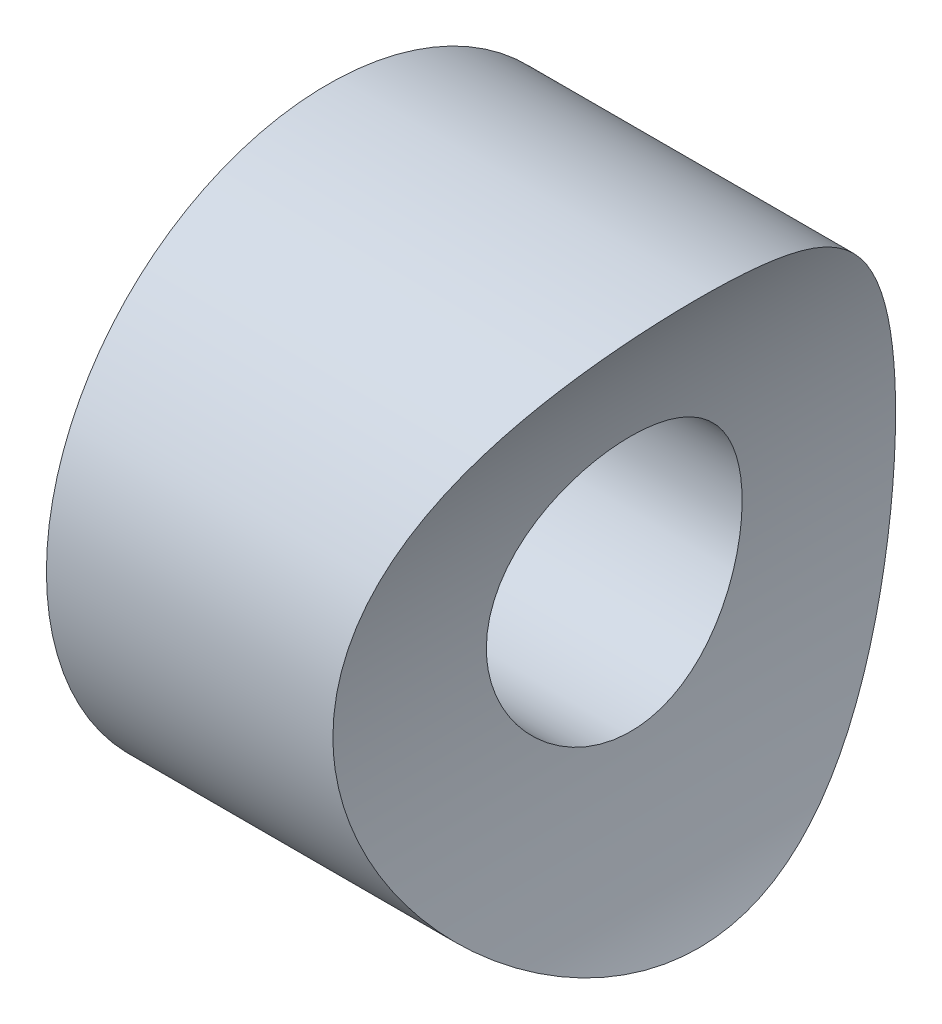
ISO-10303-21;
HEADER;
FILE_DESCRIPTION(('STEP AP214'),'2;1');
FILE_NAME('part.step','',(''),(''),'','','');
FILE_SCHEMA(('AUTOMOTIVE_DESIGN { 1 0 10303 214 1 1 1 1 }'));
ENDSEC;
DATA;
#1=APPLICATION_CONTEXT('core data for automotive mechanical design processes');
#2=APPLICATION_PROTOCOL_DEFINITION('international standard','automotive_design',2000,#1);
#3=PRODUCT_CONTEXT('',#1,'mechanical');
#4=PRODUCT('Part','Part','',(#3));
#5=PRODUCT_RELATED_PRODUCT_CATEGORY('part','',(#4));
#6=PRODUCT_DEFINITION_FORMATION('','',#4);
#7=PRODUCT_DEFINITION_CONTEXT('part definition',#1,'design');
#8=PRODUCT_DEFINITION('design','',#6,#7);
#9=PRODUCT_DEFINITION_SHAPE('','',#8);
#10=(LENGTH_UNIT() NAMED_UNIT(*) SI_UNIT(.MILLI.,.METRE.));
#11=(NAMED_UNIT(*) PLANE_ANGLE_UNIT() SI_UNIT($,.RADIAN.));
#12=(NAMED_UNIT(*) SI_UNIT($,.STERADIAN.) SOLID_ANGLE_UNIT());
#13=UNCERTAINTY_MEASURE_WITH_UNIT(LENGTH_MEASURE(1.E-05),#10,'distance_accuracy_value','');
#14=(GEOMETRIC_REPRESENTATION_CONTEXT(3) GLOBAL_UNCERTAINTY_ASSIGNED_CONTEXT((#13)) GLOBAL_UNIT_ASSIGNED_CONTEXT((#10,
#11,#12)) REPRESENTATION_CONTEXT('',''));
#15=CARTESIAN_POINT('',(0.,0.,0.));
#16=DIRECTION('',(0.,0.,1.));
#17=DIRECTION('',(1.,0.,0.));
#18=AXIS2_PLACEMENT_3D('',#15,#16,#17);
#19=CARTESIAN_POINT('',(0.,0.,0.));
#20=DIRECTION('',(1.,0.,0.));
#21=DIRECTION('',(0.,0.,-1.));
#22=AXIS2_PLACEMENT_3D('',#19,#20,#21);
#23=PLANE('',#22);
#24=CARTESIAN_POINT('',(0.,0.,0.));
#25=DIRECTION('',(1.,0.,0.));
#26=DIRECTION('',(0.,0.,-1.));
#27=AXIS2_PLACEMENT_3D('',#24,#25,#26);
#28=CIRCLE('',#27,27.5);
#29=CARTESIAN_POINT('',(0.,0.,-27.5));
#30=VERTEX_POINT('',#29);
#31=EDGE_CURVE('E10',#30,#30,#28,.T.);
#32=ORIENTED_EDGE('',*,*,#31,.F.);
#33=EDGE_LOOP('',(#32));
#34=FACE_BOUND('',#33,.T.);
#35=CARTESIAN_POINT('',(0.,0.,0.));
#36=DIRECTION('',(1.,0.,0.));
#37=DIRECTION('',(0.,0.,-1.));
#38=AXIS2_PLACEMENT_3D('',#35,#36,#37);
#39=CIRCLE('',#38,12.5);
#40=CARTESIAN_POINT('',(0.,0.,-12.5));
#41=VERTEX_POINT('',#40);
#42=EDGE_CURVE('E41',#41,#41,#39,.T.);
#43=ORIENTED_EDGE('',*,*,#42,.T.);
#44=EDGE_LOOP('',(#43));
#45=FACE_BOUND('',#44,.T.);
#46=ADVANCED_FACE('F28',(#34,#45),#23,.F.);
#47=CARTESIAN_POINT('',(40.,0.,0.));
#48=DIRECTION('',(-1.,0.,0.));
#49=DIRECTION('',(0.,0.,1.));
#50=AXIS2_PLACEMENT_3D('',#47,#48,#49);
#51=CYLINDRICAL_SURFACE('',#50,27.5);
#52=CARTESIAN_POINT('',(28.,0.,27.5));
#53=CARTESIAN_POINT('',(28.0000058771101,0.71406770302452,27.4999933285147));
#54=CARTESIAN_POINT('',(28.0153356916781,1.42829199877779,27.47214748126));
#55=CARTESIAN_POINT('',(28.0762780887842,2.85123638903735,27.3611055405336));
#56=CARTESIAN_POINT('',(28.1218996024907,3.55995479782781,27.2778931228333));
#57=CARTESIAN_POINT('',(28.2423267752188,4.96721444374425,27.0570623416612));
#58=CARTESIAN_POINT('',(28.3171671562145,5.66574254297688,26.9193792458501));
#59=CARTESIAN_POINT('',(28.4941532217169,7.04668581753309,26.5913128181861));
#60=CARTESIAN_POINT('',(28.5962971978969,7.72910199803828,26.4009327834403));
#61=CARTESIAN_POINT('',(28.8249571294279,9.07062743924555,25.970520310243));
#62=CARTESIAN_POINT('',(28.9513697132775,9.72982199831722,25.7306981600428));
#63=CARTESIAN_POINT('',(29.2259609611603,11.0241021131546,25.2033242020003));
#64=CARTESIAN_POINT('',(29.3741398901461,11.6591873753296,24.9157718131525));
#65=CARTESIAN_POINT('',(29.6890348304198,12.9019995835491,24.2954880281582));
#66=CARTESIAN_POINT('',(29.8557493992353,13.5097286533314,23.9627601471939));
#67=CARTESIAN_POINT('',(30.2042666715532,14.6952262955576,23.2546150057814));
#68=CARTESIAN_POINT('',(30.3860699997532,15.2729936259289,22.8791959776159));
#69=CARTESIAN_POINT('',(30.7740256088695,16.4349578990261,22.0608534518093));
#70=CARTESIAN_POINT('',(30.9809925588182,17.0168641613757,21.6150630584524));
#71=CARTESIAN_POINT('',(31.4033625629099,18.1415065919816,20.6801963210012));
#72=CARTESIAN_POINT('',(31.6187659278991,18.6842413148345,20.1911183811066));
#73=CARTESIAN_POINT('',(32.0533701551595,19.7288494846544,19.1717379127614));
#74=CARTESIAN_POINT('',(32.2725741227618,20.2306874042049,18.6414003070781));
#75=CARTESIAN_POINT('',(32.7095663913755,21.1909163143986,17.5421697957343));
#76=CARTESIAN_POINT('',(32.9273546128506,21.6493048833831,16.9732747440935));
#77=CARTESIAN_POINT('',(33.3774278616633,22.5634788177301,15.7411708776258));
#78=CARTESIAN_POINT('',(33.6090226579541,23.0145435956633,15.0741949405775));
#79=CARTESIAN_POINT('',(34.0568488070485,23.8584948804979,13.699373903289));
#80=CARTESIAN_POINT('',(34.2730788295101,24.2513763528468,12.9915252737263));
#81=CARTESIAN_POINT('',(34.6824358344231,24.9752178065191,11.5389135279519));
#82=CARTESIAN_POINT('',(34.8755763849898,25.3062142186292,10.7941724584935));
#83=CARTESIAN_POINT('',(35.2312084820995,25.9027263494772,9.27182878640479));
#84=CARTESIAN_POINT('',(35.3937040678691,26.168250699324,8.49423053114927));
#85=CARTESIAN_POINT('',(35.6717090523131,26.6154232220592,6.96172199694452));
#86=CARTESIAN_POINT('',(35.7895340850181,26.8013025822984,6.20846993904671));
#87=CARTESIAN_POINT('',(35.9866776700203,27.1093039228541,4.68402776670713));
#88=CARTESIAN_POINT('',(36.0659982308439,27.2314292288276,3.91283859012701));
#89=CARTESIAN_POINT('',(36.1822474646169,27.4096144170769,2.36062538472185));
#90=CARTESIAN_POINT('',(36.2192281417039,27.4657553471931,1.57961461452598));
#91=CARTESIAN_POINT('',(36.249087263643,27.5111276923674,0.0148543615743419));
#92=CARTESIAN_POINT('',(36.2419717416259,27.5003682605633,-0.768894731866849));
#93=CARTESIAN_POINT('',(36.188474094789,27.4189343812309,-2.21175930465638));
#94=CARTESIAN_POINT('',(36.1482429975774,27.3576432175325,-2.87166154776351));
#95=CARTESIAN_POINT('',(36.0378843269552,27.1880692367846,-4.18278760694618));
#96=CARTESIAN_POINT('',(35.9677603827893,27.0797921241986,-4.83401246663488));
#97=CARTESIAN_POINT('',(35.7999797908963,26.8175770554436,-6.12379733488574));
#98=CARTESIAN_POINT('',(35.7023127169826,26.6636218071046,-6.76235244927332));
#99=CARTESIAN_POINT('',(35.4825661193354,26.3117991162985,-8.02293679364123));
#100=CARTESIAN_POINT('',(35.3604850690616,26.1139289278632,-8.64496498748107));
#101=CARTESIAN_POINT('',(35.0926371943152,25.6715105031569,-9.88254045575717));
#102=CARTESIAN_POINT('',(34.946419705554,25.4260546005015,-10.4976647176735));
#103=CARTESIAN_POINT('',(34.6362462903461,24.8933689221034,-11.7049391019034));
#104=CARTESIAN_POINT('',(34.4722885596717,24.6061348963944,-12.2970868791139));
#105=CARTESIAN_POINT('',(34.1306799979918,23.9917960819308,-13.4563809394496));
#106=CARTESIAN_POINT('',(33.9530256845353,23.6646811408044,-14.0235208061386));
#107=CARTESIAN_POINT('',(33.5880668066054,22.9724465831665,-15.1308668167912));
#108=CARTESIAN_POINT('',(33.4007615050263,22.6073240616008,-15.6710708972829));
#109=CARTESIAN_POINT('',(32.9903491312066,21.7801909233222,-16.805983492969));
#110=CARTESIAN_POINT('',(32.7662583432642,21.3119845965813,-17.395832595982));
#111=CARTESIAN_POINT('',(32.3161371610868,20.3292112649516,-18.534806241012));
#112=CARTESIAN_POINT('',(32.090106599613,19.8146402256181,-19.083927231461));
#113=CARTESIAN_POINT('',(31.6414962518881,18.7410712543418,-20.1392433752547));
#114=CARTESIAN_POINT('',(31.4189188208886,18.1820444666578,-20.645410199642));
#115=CARTESIAN_POINT('',(30.9826809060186,17.0222090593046,-21.6116665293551));
#116=CARTESIAN_POINT('',(30.7690205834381,16.4213996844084,-22.0717552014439));
#117=CARTESIAN_POINT('',(30.3418088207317,15.1388160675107,-22.9721718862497));
#118=CARTESIAN_POINT('',(30.1292312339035,14.4543141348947,-23.4090895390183));
#119=CARTESIAN_POINT('',(29.7259652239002,13.0443540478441,-24.2230765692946));
#120=CARTESIAN_POINT('',(29.5352782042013,12.318893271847,-24.6001421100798));
#121=CARTESIAN_POINT('',(29.1814914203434,10.8321993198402,-25.2900063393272));
#122=CARTESIAN_POINT('',(29.018371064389,10.0709933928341,-25.6028530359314));
#123=CARTESIAN_POINT('',(28.7245751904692,8.51801920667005,-26.1605376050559));
#124=CARTESIAN_POINT('',(28.5938950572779,7.72625531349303,-26.4053851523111));
#125=CARTESIAN_POINT('',(28.379663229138,6.19385657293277,-26.8039791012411));
#126=CARTESIAN_POINT('',(28.2928557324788,5.45532781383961,-26.9640864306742));
#127=CARTESIAN_POINT('',(28.1518037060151,3.96455359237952,-27.2232352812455));
#128=CARTESIAN_POINT('',(28.0975572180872,3.21230895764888,-27.3222804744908));
#129=CARTESIAN_POINT('',(28.0232152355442,1.70092879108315,-27.4578262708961));
#130=CARTESIAN_POINT('',(28.0031014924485,0.941797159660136,-27.4943602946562));
#131=CARTESIAN_POINT('',(27.9975639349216,-0.576988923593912,-27.5044298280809));
#132=CARTESIAN_POINT('',(28.0121378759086,-1.3366433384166,-27.4779694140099));
#133=CARTESIAN_POINT('',(28.0724227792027,-2.77558379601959,-27.36813403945));
#134=CARTESIAN_POINT('',(28.1149464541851,-3.45545849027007,-27.290583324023));
#135=CARTESIAN_POINT('',(28.2268407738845,-4.8053300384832,-27.0855085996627));
#136=CARTESIAN_POINT('',(28.2962092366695,-5.47532769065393,-26.9579886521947));
#137=CARTESIAN_POINT('',(28.4602026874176,-6.80108163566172,-26.6544145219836));
#138=CARTESIAN_POINT('',(28.5548289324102,-7.45683721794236,-26.4783579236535));
#139=CARTESIAN_POINT('',(28.7672403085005,-8.75013600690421,-26.0795531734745));
#140=CARTESIAN_POINT('',(28.8850264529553,-9.38767841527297,-25.8568029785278));
#141=CARTESIAN_POINT('',(29.144125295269,-10.6551033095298,-25.3612322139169));
#142=CARTESIAN_POINT('',(29.2859056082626,-11.2844948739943,-25.087402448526));
#143=CARTESIAN_POINT('',(29.5880561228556,-12.5174523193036,-24.4955312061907));
#144=CARTESIAN_POINT('',(29.7484263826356,-13.1210181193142,-24.1774895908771));
#145=CARTESIAN_POINT('',(30.084542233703,-14.2998147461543,-23.4995271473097));
#146=CARTESIAN_POINT('',(30.2602914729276,-14.8750387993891,-23.1395963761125));
#147=CARTESIAN_POINT('',(30.6237365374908,-15.9948797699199,-22.3801589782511));
#148=CARTESIAN_POINT('',(30.8114334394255,-16.5394939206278,-21.9806487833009));
#149=CARTESIAN_POINT('',(31.1099562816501,-17.3614967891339,-21.3299986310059));
#150=CARTESIAN_POINT('',(31.2179245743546,-17.6502029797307,-21.091709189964));
#151=CARTESIAN_POINT('',(31.4357781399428,-18.2171747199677,-20.6039886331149));
#152=CARTESIAN_POINT('',(31.5456629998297,-18.495442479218,-20.3545599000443));
#153=CARTESIAN_POINT('',(31.8772958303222,-19.3143180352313,-19.5899192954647));
#154=CARTESIAN_POINT('',(32.1010269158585,-19.8390113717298,-19.058342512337));
#155=CARTESIAN_POINT('',(32.5485582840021,-20.8439299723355,-17.9537944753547));
#156=CARTESIAN_POINT('',(32.7723584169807,-21.3241108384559,-17.3807828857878));
#157=CARTESIAN_POINT('',(33.2142557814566,-22.2372295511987,-16.1961381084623));
#158=CARTESIAN_POINT('',(33.4323527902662,-22.6701655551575,-15.584503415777));
#159=CARTESIAN_POINT('',(33.873538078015,-23.518104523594,-14.2759573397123));
#160=CARTESIAN_POINT('',(34.0956922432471,-23.9290849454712,-13.5761143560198));
#161=CARTESIAN_POINT('',(34.5189552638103,-24.6898431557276,-12.1376918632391));
#162=CARTESIAN_POINT('',(34.7200624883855,-25.0396162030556,-11.3991093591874));
#163=CARTESIAN_POINT('',(35.0932004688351,-25.6737583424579,-9.88829638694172));
#164=CARTESIAN_POINT('',(35.2652656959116,-25.9582051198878,-9.11610719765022));
#165=CARTESIAN_POINT('',(35.5730279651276,-26.4582405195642,-7.54271108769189));
#166=CARTESIAN_POINT('',(35.7087318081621,-26.6738420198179,-6.7415096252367));
#167=CARTESIAN_POINT('',(35.9260388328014,-27.0151559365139,-5.19574202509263));
#168=CARTESIAN_POINT('',(36.0116097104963,-27.1475534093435,-4.45320929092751));
#169=CARTESIAN_POINT('',(36.1438828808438,-27.3510573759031,-2.95634012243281));
#170=CARTESIAN_POINT('',(36.190588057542,-27.4221684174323,-2.20200456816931));
#171=CARTESIAN_POINT('',(36.242918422,-27.5017895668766,-0.689161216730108));
#172=CARTESIAN_POINT('',(36.2485736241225,-27.5103454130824,0.0693431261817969));
#173=CARTESIAN_POINT('',(36.2186049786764,-27.4648103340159,1.58360896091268));
#174=CARTESIAN_POINT('',(36.1829845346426,-27.4107245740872,2.33937067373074));
#175=CARTESIAN_POINT('',(36.0797489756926,-27.2525215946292,3.73846143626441));
#176=CARTESIAN_POINT('',(36.0171583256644,-27.1562313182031,4.38307060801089));
#177=CARTESIAN_POINT('',(35.8646164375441,-26.9189402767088,5.66062477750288));
#178=CARTESIAN_POINT('',(35.7746683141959,-26.777944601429,6.293571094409));
#179=CARTESIAN_POINT('',(35.5702131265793,-26.4527880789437,7.54438751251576));
#180=CARTESIAN_POINT('',(35.4556982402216,-26.2686134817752,8.1622527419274));
#181=CARTESIAN_POINT('',(35.2054472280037,-25.8589215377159,9.37969962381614));
#182=CARTESIAN_POINT('',(35.069709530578,-25.6334011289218,9.97927991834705));
#183=CARTESIAN_POINT('',(34.7717590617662,-25.1278810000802,11.1936688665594));
#184=CARTESIAN_POINT('',(34.6084351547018,-24.8453938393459,11.8071681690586));
#185=CARTESIAN_POINT('',(34.2663033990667,-24.2380944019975,13.0083749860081));
#186=CARTESIAN_POINT('',(34.0874939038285,-23.9132776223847,13.5960797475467));
#187=CARTESIAN_POINT('',(33.7186746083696,-23.2232059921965,14.7438551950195));
#188=CARTESIAN_POINT('',(33.5286607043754,-22.8579362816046,15.3039156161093));
#189=CARTESIAN_POINT('',(33.1417009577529,-22.0888735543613,16.3944169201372));
#190=CARTESIAN_POINT('',(32.9447546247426,-21.6850778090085,16.9248557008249));
#191=CARTESIAN_POINT('',(32.5168276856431,-20.7743175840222,18.0352738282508));
#192=CARTESIAN_POINT('',(32.2853577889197,-20.2611084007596,18.6099581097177));
#193=CARTESIAN_POINT('',(31.8245785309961,-19.1877977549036,19.714757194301));
#194=CARTESIAN_POINT('',(31.5952693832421,-18.627691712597,20.2448676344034));
#195=CARTESIAN_POINT('',(31.1444098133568,-17.4626472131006,21.257992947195));
#196=CARTESIAN_POINT('',(30.9228652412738,-16.8576759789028,21.7409727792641));
#197=CARTESIAN_POINT('',(30.4932572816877,-15.6059978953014,22.6562104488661));
#198=CARTESIAN_POINT('',(30.2851934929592,-14.9592922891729,23.088469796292));
#199=CARTESIAN_POINT('',(29.8808867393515,-13.603977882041,23.9130230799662));
#200=CARTESIAN_POINT('',(29.6853106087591,-12.8939958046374,24.3033934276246));
#201=CARTESIAN_POINT('',(29.3197832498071,-11.4368114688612,25.0221761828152));
#202=CARTESIAN_POINT('',(29.1498354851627,-10.6896041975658,25.3505802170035));
#203=CARTESIAN_POINT('',(28.841019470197,-9.16505496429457,25.9406715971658));
#204=CARTESIAN_POINT('',(28.7020824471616,-8.38778426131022,26.2025067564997));
#205=CARTESIAN_POINT('',(28.4592306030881,-6.80806921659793,26.6566082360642));
#206=CARTESIAN_POINT('',(28.3552974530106,-6.00563829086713,26.8489109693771));
#207=CARTESIAN_POINT('',(28.2260282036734,-4.76822030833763,27.0869492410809));
#208=CARTESIAN_POINT('',(28.1867978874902,-4.33953900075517,27.1589347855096));
#209=CARTESIAN_POINT('',(28.1192776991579,-3.47848089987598,27.2825803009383));
#210=CARTESIAN_POINT('',(28.0909847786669,-3.04610517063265,27.3342459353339));
#211=CARTESIAN_POINT('',(28.0456048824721,-2.17876569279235,27.4170163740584));
#212=CARTESIAN_POINT('',(28.0285189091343,-1.74380171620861,27.4481193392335));
#213=CARTESIAN_POINT('',(28.0057141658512,-0.872578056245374,27.4896141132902));
#214=CARTESIAN_POINT('',(27.9999964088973,-0.43631826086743,27.5000040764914));
#215=CARTESIAN_POINT('',(28.,0.,27.5));
#216=B_SPLINE_CURVE_WITH_KNOTS('',3,(#52,#53,#54,#55,#56,#57,#58,#59,#60,#61,#62,#63,#64,#65,
#66,#67,#68,#69,#70,#71,#72,#73,#74,#75,#76,#77,#78,#79,#80,#81,#82,#83,#84,#85,#86,#87,#88,#89,
#90,#91,#92,#93,#94,#95,#96,#97,#98,#99,#100,#101,#102,#103,#104,#105,#106,#107,#108,#109,#110,
#111,#112,#113,#114,#115,#116,#117,#118,#119,#120,#121,#122,#123,#124,#125,#126,#127,#128,#129,
#130,#131,#132,#133,#134,#135,#136,#137,#138,#139,#140,#141,#142,#143,#144,#145,#146,#147,#148,
#149,#150,#151,#152,#153,#154,#155,#156,#157,#158,#159,#160,#161,#162,#163,#164,#165,#166,#167,
#168,#169,#170,#171,#172,#173,#174,#175,#176,#177,#178,#179,#180,#181,#182,#183,#184,#185,#186,
#187,#188,#189,#190,#191,#192,#193,#194,#195,#196,#197,#198,#199,#200,#201,#202,#203,#204,#205,
#206,#207,#208,#209,#210,#211,#212,#213,#214,#215),.UNSPECIFIED.,.T.,.F.,(4,2,2,2,2,2,2,2,2,2,2,
2,2,2,2,2,2,2,2,2,2,2,2,2,2,2,2,2,2,2,2,2,2,2,2,2,2,2,2,2,2,2,2,2,2,2,2,2,2,2,2,2,2,2,2,2,2,2,2,
2,2,2,2,2,2,2,2,2,2,2,2,2,2,2,2,2,2,2,2,2,2,4),(0.,2.14177250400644,4.28417676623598,
6.42913472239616,8.57395850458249,10.7098414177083,12.8457503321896,14.9814931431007,
17.1173244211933,19.4000485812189,21.68285692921,23.9676276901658,26.2525257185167,
28.7628983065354,31.2734879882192,33.7825950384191,36.2913711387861,38.6420518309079,
40.9926098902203,43.3402777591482,45.6876244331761,47.6771485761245,49.6664312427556,
51.6564679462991,53.6466291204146,55.6793470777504,57.7122719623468,59.7457154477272,
61.7793144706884,64.1339674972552,66.4888256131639,68.8452249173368,71.2016668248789,
73.7165989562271,76.2316922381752,78.7448984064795,81.2577468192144,83.5365576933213,
85.8152315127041,88.0926866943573,90.3699945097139,92.4244014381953,94.4786414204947,
96.5329836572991,98.5874158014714,100.687835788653,102.788262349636,104.889188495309,
106.9903042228,108.158839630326,109.327126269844,111.663646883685,114.002473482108,
116.341391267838,118.862464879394,121.383733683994,123.901988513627,126.419772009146,
128.69362320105,130.967305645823,133.239325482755,135.511157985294,137.47323917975,
139.435097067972,141.397580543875,143.360209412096,145.442803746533,147.525619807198,
149.609203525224,151.692934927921,154.103779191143,156.514859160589,158.927718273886,
161.340505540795,163.837578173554,166.334987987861,168.826803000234,171.317311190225,
172.626134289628,173.934592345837,175.24316741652,176.55185908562),.UNSPECIFIED.);
#217=CARTESIAN_POINT('',(28.,0.,27.5));
#218=VERTEX_POINT('',#217);
#219=EDGE_CURVE('E45',#218,#218,#216,.T.);
#220=ORIENTED_EDGE('',*,*,#219,.T.);
#221=EDGE_LOOP('',(#220));
#222=FACE_BOUND('',#221,.T.);
#223=ORIENTED_EDGE('',*,*,#31,.T.);
#224=EDGE_LOOP('',(#223));
#225=FACE_BOUND('',#224,.T.);
#226=ADVANCED_FACE('F30',(#222,#225),#51,.T.);
#227=CARTESIAN_POINT('',(40.,0.,0.));
#228=DIRECTION('',(-1.,0.,0.));
#229=DIRECTION('',(0.,0.,1.));
#230=AXIS2_PLACEMENT_3D('',#227,#228,#229);
#231=CYLINDRICAL_SURFACE('',#230,12.5);
#232=CARTESIAN_POINT('',(28.,0.,12.5));
#233=CARTESIAN_POINT('',(28.0000008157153,0.345345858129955,12.499998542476));
#234=CARTESIAN_POINT('',(28.0035868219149,0.690720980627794,12.4856762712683));
#235=CARTESIAN_POINT('',(28.0178337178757,1.37897685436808,12.4285034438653));
#236=CARTESIAN_POINT('',(28.0284954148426,1.7218573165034,12.3856496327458));
#237=CARTESIAN_POINT('',(28.0566047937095,2.40280021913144,12.2717468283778));
#238=CARTESIAN_POINT('',(28.0740559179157,2.74086012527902,12.2006835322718));
#239=CARTESIAN_POINT('',(28.1152622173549,3.40956959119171,12.0309531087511));
#240=CARTESIAN_POINT('',(28.1390172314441,3.74021934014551,11.932286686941));
#241=CARTESIAN_POINT('',(28.1921498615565,4.39143160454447,11.7082770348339));
#242=CARTESIAN_POINT('',(28.2215206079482,4.71200589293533,11.5829663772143));
#243=CARTESIAN_POINT('',(28.2851109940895,5.34133409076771,11.3065586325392));
#244=CARTESIAN_POINT('',(28.3193306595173,5.65008793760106,11.1554614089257));
#245=CARTESIAN_POINT('',(28.3917041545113,6.25375145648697,10.8285920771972));
#246=CARTESIAN_POINT('',(28.4298579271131,6.54866132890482,10.6528203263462));
#247=CARTESIAN_POINT('',(28.5090904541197,7.1227706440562,10.2778258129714));
#248=CARTESIAN_POINT('',(28.5501693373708,7.40196939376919,10.0786020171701));
#249=CARTESIAN_POINT('',(28.6349442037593,7.94789184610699,9.65415754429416));
#250=CARTESIAN_POINT('',(28.6786745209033,8.21428968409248,9.42852450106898));
#251=CARTESIAN_POINT('',(28.7668484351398,8.7272289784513,8.95584237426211));
#252=CARTESIAN_POINT('',(28.8112920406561,8.97377020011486,8.70879303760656));
#253=CARTESIAN_POINT('',(28.899676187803,9.44541093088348,8.19486829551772));
#254=CARTESIAN_POINT('',(28.9436166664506,9.67050778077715,7.92799043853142));
#255=CARTESIAN_POINT('',(29.0297670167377,10.097711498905,7.37617587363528));
#256=CARTESIAN_POINT('',(29.071976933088,10.2998189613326,7.09123963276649));
#257=CARTESIAN_POINT('',(29.1540851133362,10.6824846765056,6.50077864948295));
#258=CARTESIAN_POINT('',(29.1939395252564,10.8626766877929,6.19501027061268));
#259=CARTESIAN_POINT('',(29.269460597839,11.1965999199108,5.56884605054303));
#260=CARTESIAN_POINT('',(29.3051272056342,11.3503308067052,5.24845002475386));
#261=CARTESIAN_POINT('',(29.3711884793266,11.6301059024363,4.59530579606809));
#262=CARTESIAN_POINT('',(29.4015838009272,11.7561535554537,4.26255913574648));
#263=CARTESIAN_POINT('',(29.4561664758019,11.9795435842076,3.58707023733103));
#264=CARTESIAN_POINT('',(29.4803539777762,12.0768866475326,3.24432823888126));
#265=CARTESIAN_POINT('',(29.5213430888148,12.2403753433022,2.55832805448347));
#266=CARTESIAN_POINT('',(29.5382829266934,12.3071067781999,2.21521770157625));
#267=CARTESIAN_POINT('',(29.564945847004,12.4116255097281,1.52433762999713));
#268=CARTESIAN_POINT('',(29.5746690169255,12.4494131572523,1.17656796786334));
#269=CARTESIAN_POINT('',(29.5865942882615,12.4957081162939,0.479005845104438));
#270=CARTESIAN_POINT('',(29.5887974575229,12.5042195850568,0.129213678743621));
#271=CARTESIAN_POINT('',(29.5856164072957,12.4918975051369,-0.569816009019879));
#272=CARTESIAN_POINT('',(29.5802322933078,12.4710643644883,-0.919053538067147));
#273=CARTESIAN_POINT('',(29.5622673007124,12.4011011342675,-1.60591279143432));
#274=CARTESIAN_POINT('',(29.5498643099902,12.3526702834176,-1.94361068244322));
#275=CARTESIAN_POINT('',(29.5183644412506,12.2284550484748,-2.61361187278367));
#276=CARTESIAN_POINT('',(29.4992676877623,12.1526711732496,-2.94591527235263));
#277=CARTESIAN_POINT('',(29.4549366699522,11.9743582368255,-3.60285956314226));
#278=CARTESIAN_POINT('',(29.429702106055,11.8718278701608,-3.92750007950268));
#279=CARTESIAN_POINT('',(29.3738196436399,11.6408201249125,-4.56693246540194));
#280=CARTESIAN_POINT('',(29.3431716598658,11.5123423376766,-4.8817241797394));
#281=CARTESIAN_POINT('',(29.2769917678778,11.2289731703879,-5.50252257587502));
#282=CARTESIAN_POINT('',(29.2414137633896,11.0738287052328,-5.80840878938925));
#283=CARTESIAN_POINT('',(29.1666119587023,10.7391618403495,-6.4060680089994));
#284=CARTESIAN_POINT('',(29.1273881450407,10.5596393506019,-6.69784096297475));
#285=CARTESIAN_POINT('',(29.0463669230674,10.1774241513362,-7.26547516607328));
#286=CARTESIAN_POINT('',(29.0045691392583,9.97472805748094,-7.54133408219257));
#287=CARTESIAN_POINT('',(28.9195334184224,9.54752439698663,-8.07537681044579));
#288=CARTESIAN_POINT('',(28.8762954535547,9.32301640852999,-8.33356028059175));
#289=CARTESIAN_POINT('',(28.7882917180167,8.84692110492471,-8.83773744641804));
#290=CARTESIAN_POINT('',(28.7435175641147,8.59474378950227,-9.08317289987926));
#291=CARTESIAN_POINT('',(28.654912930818,8.07050421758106,-9.551995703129));
#292=CARTESIAN_POINT('',(28.611082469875,7.79844157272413,-9.77538262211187));
#293=CARTESIAN_POINT('',(28.5255822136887,7.23621606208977,-10.1985771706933));
#294=CARTESIAN_POINT('',(28.4839125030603,6.94605248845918,-10.3983838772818));
#295=CARTESIAN_POINT('',(28.4038956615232,6.34956444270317,-10.772978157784));
#296=CARTESIAN_POINT('',(28.3655485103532,6.0432400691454,-10.947765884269));
#297=CARTESIAN_POINT('',(28.2931243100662,5.41541235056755,-11.2715789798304));
#298=CARTESIAN_POINT('',(28.2590625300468,5.09386005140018,-11.4205129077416));
#299=CARTESIAN_POINT('',(28.1963335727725,4.43881192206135,-11.6907000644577));
#300=CARTESIAN_POINT('',(28.1676664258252,4.10531602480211,-11.8119531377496));
#301=CARTESIAN_POINT('',(28.1165546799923,3.42883552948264,-12.0257598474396));
#302=CARTESIAN_POINT('',(28.0941091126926,3.08585241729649,-12.1183179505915));
#303=CARTESIAN_POINT('',(28.0560868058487,2.39289058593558,-12.2739631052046));
#304=CARTESIAN_POINT('',(28.0405098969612,2.04291203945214,-12.3370508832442));
#305=CARTESIAN_POINT('',(28.016985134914,1.34763092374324,-12.4319680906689));
#306=CARTESIAN_POINT('',(28.0088521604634,1.00243806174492,-12.4645564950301));
#307=CARTESIAN_POINT('',(27.9997665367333,0.310446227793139,-12.5009464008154));
#308=CARTESIAN_POINT('',(27.9988137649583,-0.0363527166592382,-12.5047483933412));
#309=CARTESIAN_POINT('',(28.0041149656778,-0.728982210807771,-12.4835341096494));
#310=CARTESIAN_POINT('',(28.0103683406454,-1.07481283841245,-12.458520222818));
#311=CARTESIAN_POINT('',(28.0299058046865,-1.76300446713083,-12.3798934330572));
#312=CARTESIAN_POINT('',(28.0431898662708,-2.10536548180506,-12.3262806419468));
#313=CARTESIAN_POINT('',(28.0761711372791,-2.77909750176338,-12.1919176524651));
#314=CARTESIAN_POINT('',(28.0957701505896,-3.11055621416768,-12.1115824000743));
#315=CARTESIAN_POINT('',(28.1409055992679,-3.76542622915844,-11.9242422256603));
#316=CARTESIAN_POINT('',(28.1664419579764,-4.08883763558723,-11.8172376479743));
#317=CARTESIAN_POINT('',(28.2227760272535,-4.72547495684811,-11.5773748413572));
#318=CARTESIAN_POINT('',(28.2535741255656,-5.03870011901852,-11.4445147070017));
#319=CARTESIAN_POINT('',(28.3196208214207,-5.65290579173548,-11.1539268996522));
#320=CARTESIAN_POINT('',(28.3548695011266,-5.95388607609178,-10.996198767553));
#321=CARTESIAN_POINT('',(28.4295561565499,-6.54690733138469,-10.6539790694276));
#322=CARTESIAN_POINT('',(28.4690573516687,-6.83869503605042,-10.4690623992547));
#323=CARTESIAN_POINT('',(28.5506602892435,-7.40573208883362,-10.075919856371));
#324=CARTESIAN_POINT('',(28.5927620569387,-7.68098127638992,-9.86769375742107));
#325=CARTESIAN_POINT('',(28.678448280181,-8.21323439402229,-9.42929844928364));
#326=CARTESIAN_POINT('',(28.7220329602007,-8.47023554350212,-9.19912590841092));
#327=CARTESIAN_POINT('',(28.8095132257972,-8.96431645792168,-8.71836265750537));
#328=CARTESIAN_POINT('',(28.8534088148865,-9.20139599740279,-8.46777171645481));
#329=CARTESIAN_POINT('',(28.9413979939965,-9.65967669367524,-7.94137233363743));
#330=CARTESIAN_POINT('',(28.985469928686,-9.8803443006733,-7.66509543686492));
#331=CARTESIAN_POINT('',(29.0714389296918,-10.2976362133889,-7.09461670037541));
#332=CARTESIAN_POINT('',(29.113335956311,-10.494260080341,-6.80041453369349));
#333=CARTESIAN_POINT('',(29.1937347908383,-10.8620404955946,-6.19606290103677));
#334=CARTESIAN_POINT('',(29.2322366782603,-11.0331976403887,-5.88591380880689));
#335=CARTESIAN_POINT('',(29.3047025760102,-11.3487546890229,-5.25177939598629));
#336=CARTESIAN_POINT('',(29.3386666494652,-11.493154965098,-4.92779426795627));
#337=CARTESIAN_POINT('',(29.4008392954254,-11.7532704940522,-4.27023312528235));
#338=CARTESIAN_POINT('',(29.4290811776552,-11.8691526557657,-3.93672631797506));
#339=CARTESIAN_POINT('',(29.4791975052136,-12.0723939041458,-3.26065850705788));
#340=CARTESIAN_POINT('',(29.5010719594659,-12.1597530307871,-2.91809751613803));
#341=CARTESIAN_POINT('',(29.5377660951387,-12.3051825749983,-2.22650410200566));
#342=CARTESIAN_POINT('',(29.5525870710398,-12.363258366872,-1.87747287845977));
#343=CARTESIAN_POINT('',(29.574709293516,-12.4496272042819,-1.17551084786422));
#344=CARTESIAN_POINT('',(29.582010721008,-12.4779209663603,-0.822580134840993));
#345=CARTESIAN_POINT('',(29.5887627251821,-12.5040902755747,-0.125690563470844));
#346=CARTESIAN_POINT('',(29.5884329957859,-12.5028170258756,0.218234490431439));
#347=CARTESIAN_POINT('',(29.5804716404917,-12.4719496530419,0.904721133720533));
#348=CARTESIAN_POINT('',(29.5728401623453,-12.4423561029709,1.24728275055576));
#349=CARTESIAN_POINT('',(29.550506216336,-12.3551031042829,1.92856624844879));
#350=CARTESIAN_POINT('',(29.5358039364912,-12.2974444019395,2.26728823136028));
#351=CARTESIAN_POINT('',(29.4997683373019,-12.1545443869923,2.93850126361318));
#352=CARTESIAN_POINT('',(29.478434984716,-12.0693029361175,3.2709922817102));
#353=CARTESIAN_POINT('',(29.4299120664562,-11.872520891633,3.9254704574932));
#354=CARTESIAN_POINT('',(29.4027583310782,-11.7611408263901,4.24750858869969));
#355=CARTESIAN_POINT('',(29.3432967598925,-11.512668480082,4.8810071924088));
#356=CARTESIAN_POINT('',(29.3109889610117,-11.3755763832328,5.19246774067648));
#357=CARTESIAN_POINT('',(29.2421196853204,-11.0766699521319,5.80283282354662));
#358=CARTESIAN_POINT('',(29.2055577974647,-10.9148532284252,6.10173614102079));
#359=CARTESIAN_POINT('',(29.1291832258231,-10.5676324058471,6.6850856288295));
#360=CARTESIAN_POINT('',(29.0893704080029,-10.3822273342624,6.96953120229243));
#361=CARTESIAN_POINT('',(29.0064961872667,-9.98393796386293,7.52941321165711));
#362=CARTESIAN_POINT('',(28.9633771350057,-9.77046302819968,7.80442110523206));
#363=CARTESIAN_POINT('',(28.8760410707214,-9.32142482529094,8.33558565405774));
#364=CARTESIAN_POINT('',(28.8318240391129,-9.08586116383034,8.59174197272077));
#365=CARTESIAN_POINT('',(28.7435053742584,-8.59419030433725,9.08354529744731));
#366=CARTESIAN_POINT('',(28.6994037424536,-8.33808285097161,9.31919204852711));
#367=CARTESIAN_POINT('',(28.612499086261,-7.80686919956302,9.76851402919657));
#368=CARTESIAN_POINT('',(28.5696966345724,-7.53175479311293,9.98217966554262));
#369=CARTESIAN_POINT('',(28.4858188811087,-6.95924298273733,10.3896396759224));
#370=CARTESIAN_POINT('',(28.4447890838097,-6.66153155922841,10.5830025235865));
#371=CARTESIAN_POINT('',(28.3664814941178,-6.05050823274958,10.9438189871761));
#372=CARTESIAN_POINT('',(28.3292020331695,-5.73720336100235,11.1112841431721));
#373=CARTESIAN_POINT('',(28.2594483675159,-5.09716652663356,11.4190604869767));
#374=CARTESIAN_POINT('',(28.2269722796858,-4.7704398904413,11.5593823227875));
#375=CARTESIAN_POINT('',(28.1677439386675,-4.10578919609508,11.8118084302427));
#376=CARTESIAN_POINT('',(28.1409908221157,-3.7678668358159,11.9239169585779));
#377=CARTESIAN_POINT('',(28.0984121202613,-3.14787089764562,12.1005925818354));
#378=CARTESIAN_POINT('',(28.0814772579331,-2.86728001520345,12.1701379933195));
#379=CARTESIAN_POINT('',(28.052205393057,-2.3017294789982,12.2896522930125));
#380=CARTESIAN_POINT('',(28.0398680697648,-2.01677013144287,12.339622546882));
#381=CARTESIAN_POINT('',(28.0200302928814,-1.44387788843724,12.4196972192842));
#382=CARTESIAN_POINT('',(28.0125303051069,-1.15594470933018,12.4497997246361));
#383=CARTESIAN_POINT('',(28.0025154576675,-0.578680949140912,12.4899491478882));
#384=CARTESIAN_POINT('',(27.9999993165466,-0.289350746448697,12.500001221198));
#385=CARTESIAN_POINT('',(28.,0.,12.5));
#386=B_SPLINE_CURVE_WITH_KNOTS('',3,(#232,#233,#234,#235,#236,#237,#238,#239,#240,#241,#242,
#243,#244,#245,#246,#247,#248,#249,#250,#251,#252,#253,#254,#255,#256,#257,#258,#259,#260,#261,
#262,#263,#264,#265,#266,#267,#268,#269,#270,#271,#272,#273,#274,#275,#276,#277,#278,#279,#280,
#281,#282,#283,#284,#285,#286,#287,#288,#289,#290,#291,#292,#293,#294,#295,#296,#297,#298,#299,
#300,#301,#302,#303,#304,#305,#306,#307,#308,#309,#310,#311,#312,#313,#314,#315,#316,#317,#318,
#319,#320,#321,#322,#323,#324,#325,#326,#327,#328,#329,#330,#331,#332,#333,#334,#335,#336,#337,
#338,#339,#340,#341,#342,#343,#344,#345,#346,#347,#348,#349,#350,#351,#352,#353,#354,#355,#356,
#357,#358,#359,#360,#361,#362,#363,#364,#365,#366,#367,#368,#369,#370,#371,#372,#373,#374,#375,
#376,#377,#378,#379,#380,#381,#382,#383,#384,#385),.UNSPECIFIED.,.T.,.F.,(4,2,2,2,2,2,2,2,2,2,2,
2,2,2,2,2,2,2,2,2,2,2,2,2,2,2,2,2,2,2,2,2,2,2,2,2,2,2,2,2,2,2,2,2,2,2,2,2,2,2,2,2,2,2,2,2,2,2,2,
2,2,2,2,2,2,2,2,2,2,2,2,2,2,2,2,2,4),(0.,1.03577386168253,2.0716659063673,3.10808384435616,
4.1444752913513,5.17960695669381,6.21474410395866,7.24986626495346,8.2850340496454,
9.33933066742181,10.3936397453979,11.4480793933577,12.5024917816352,13.5726259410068,
14.6427736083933,15.7127880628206,16.7827768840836,17.8313349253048,18.879880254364,
19.928276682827,20.97665853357,21.9995889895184,23.0225004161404,24.0454617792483,
25.0684392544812,26.1017236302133,27.1350118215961,28.1684511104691,29.2019103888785,
30.2648664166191,31.3278432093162,32.3908615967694,33.4538735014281,34.520571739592,
35.5872759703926,36.6538140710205,37.7203258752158,38.7595309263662,39.7987182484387,
40.8378194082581,41.8769165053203,42.9005782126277,43.9242267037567,44.9479506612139,
45.9716935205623,47.0135955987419,48.0555077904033,49.0975784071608,50.1396608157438,
51.2073584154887,52.2750754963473,53.3427675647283,54.4104447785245,55.4717160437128,
56.5329858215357,57.5940607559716,58.6551101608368,59.6856519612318,60.7161729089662,
61.7466664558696,62.7771651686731,63.8014935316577,64.8258145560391,65.8502346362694,
66.8746969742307,67.9258821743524,68.9770861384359,70.0283031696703,71.0799770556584,
72.1507569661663,73.2210583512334,74.2909390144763,75.3606581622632,76.22868967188,
77.0966606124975,77.9647151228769,78.8325464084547),.UNSPECIFIED.);
#387=CARTESIAN_POINT('',(28.,0.,12.5));
#388=VERTEX_POINT('',#387);
#389=EDGE_CURVE('E33',#388,#388,#386,.T.);
#390=ORIENTED_EDGE('',*,*,#389,.F.);
#391=EDGE_LOOP('',(#390));
#392=FACE_BOUND('',#391,.T.);
#393=ORIENTED_EDGE('',*,*,#42,.F.);
#394=EDGE_LOOP('',(#393));
#395=FACE_BOUND('',#394,.T.);
#396=ADVANCED_FACE('F54',(#392,#395),#231,.F.);
#397=CARTESIAN_POINT('',(78.,0.,-35.));
#398=DIRECTION('',(0.,0.,1.));
#399=DIRECTION('',(1.,0.,0.));
#400=AXIS2_PLACEMENT_3D('',#397,#398,#399);
#401=CYLINDRICAL_SURFACE('',#400,50.);
#402=ORIENTED_EDGE('',*,*,#389,.T.);
#403=EDGE_LOOP('',(#402));
#404=FACE_BOUND('',#403,.T.);
#405=ORIENTED_EDGE('',*,*,#219,.F.);
#406=EDGE_LOOP('',(#405));
#407=FACE_BOUND('',#406,.T.);
#408=ADVANCED_FACE('F51',(#404,#407),#401,.F.);
#409=CLOSED_SHELL('',(#46,#226,#396,#408));
#410=MANIFOLD_SOLID_BREP('B2',#409);
#411=ADVANCED_BREP_SHAPE_REPRESENTATION('',(#18,#410),#14);
#412=SHAPE_DEFINITION_REPRESENTATION(#9,#411);
ENDSEC;
END-ISO-10303-21;
